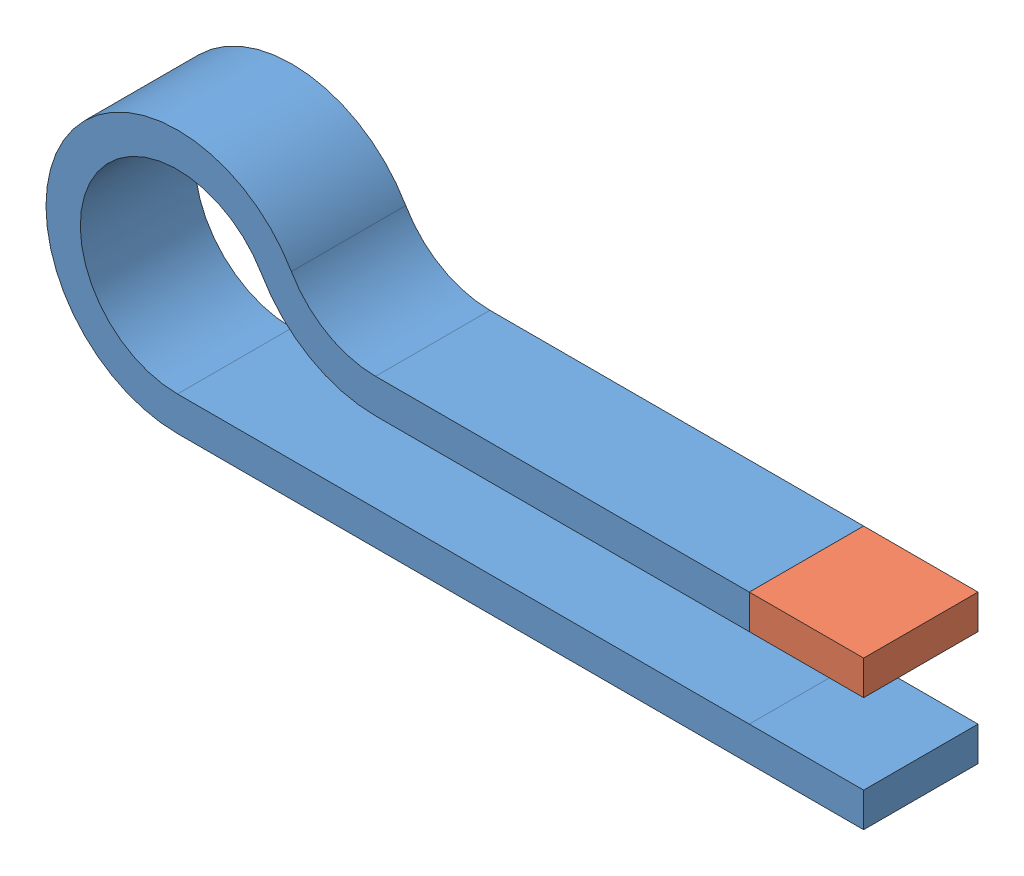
SolidWorks assembly CLIP.SLDASM, configuration Default (file format 3800). Lengths in mm.
Overall size (35.75 11.5 5).
2 component instances, 2 part files, 3 mates.
Components (placement in the parent):
- clip 01-1: clip 01.SLDPRT [Default] at origin size (35.75 11.5 5)
- clip 02-1: clip 02.SLDPRT [Default] at (25 1.5 0) x (0 0 -1) z (1 0 0) size (5 1.5 5)
Mates (geometry in assembly coordinates):
- Coincident3: coincident aligned: plane of clip 02-1 through (30 5.75 -2.5) normal (0 1 0); plane of clip 01-1 through (8.6603 5.75 2.5) normal (0 1 0)
- Coincident4: coincident anti-aligned: plane of clip 01-1 through (25 5.75 2.5) normal (1 0 0); plane of clip 02-1 through (25 5.75 2.5) normal (-1 0 0)
- Coincident5: coincident aligned: plane of clip 01-1 through (0 0.75 2.5) normal (0 0 1); plane of clip 02-1 through (30 5.75 2.5) normal (0 0 1)
